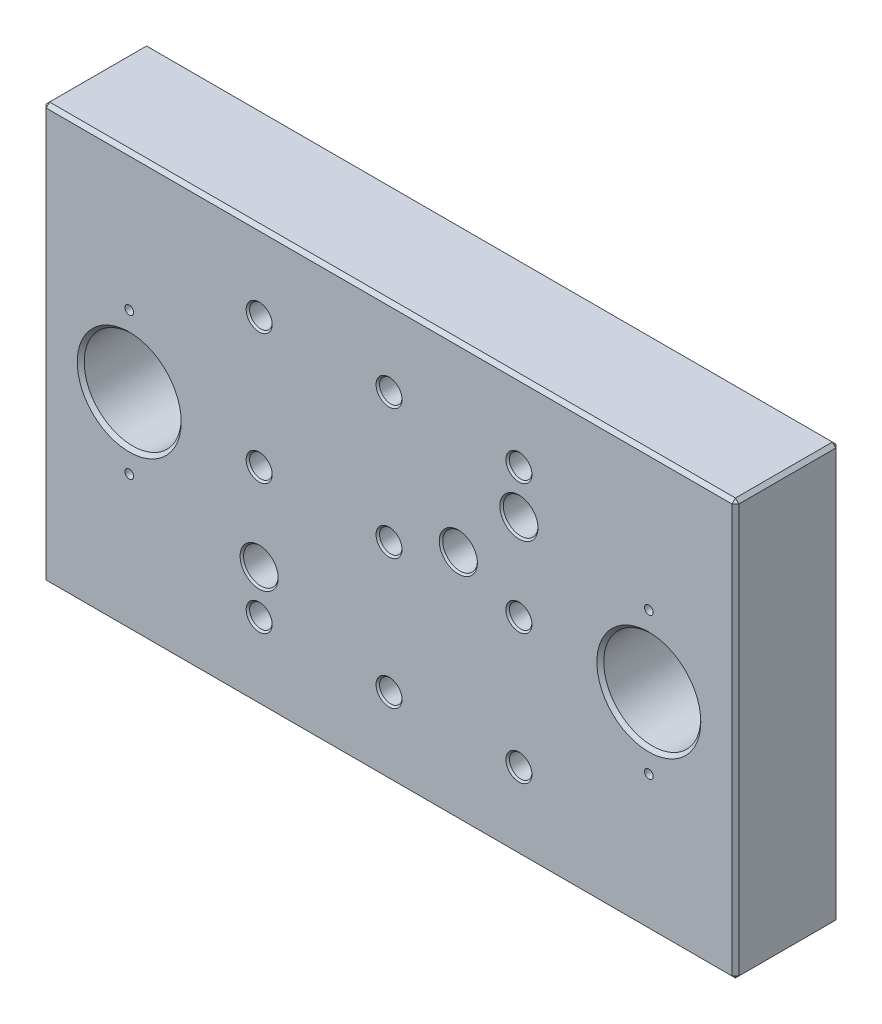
from build123d import *

# Parameters (mm, degrees)
ESQUISSE1_W               = 200
ESQUISSE1_H               = 120
ESQUISSE1_R               = 5
ESQUISSE1_R_2             = 3.25
ESQUISSE1_R_3             = 14
EMBASE_DEPTH              = 30
ESQUISSE2_R               = 5
LAMAGES_VIS_PAUL_ES_DEPTH = 17.5
ESQUISSE4_R               = 6
LAMAGES_VIS_DEPTH         = 20
CHANF_1_SIZE              = 1
CHANF_0_5_SIZE            = 0.5
FIXATION_COLONNE_D        = 2.5
FIXATION_COLONNE_DEPTH    = 12.5
FIXATION_COLONNE_TIP      = 0.751075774


with BuildPart() as part:
    # Esquisse1 → Embase (new body)
    with BuildSketch(Plane.XY):
        Rectangle(ESQUISSE1_W, ESQUISSE1_H)
        with Locations((37.5, 25)):
            Circle(ESQUISSE1_R, mode=Mode.SUBTRACT)
        with Locations((0, 37.5)):
            Circle(ESQUISSE1_R_2, mode=Mode.SUBTRACT)
        with Locations((-37.5, 37.5)):
            Circle(ESQUISSE1_R_2, mode=Mode.SUBTRACT)
        with Locations((37.5, 37.5)):
            Circle(ESQUISSE1_R_2, mode=Mode.SUBTRACT)
        with Locations((37.5, 0)):
            Circle(ESQUISSE1_R_2, mode=Mode.SUBTRACT)
        with Locations((37.5, -37.5)):
            Circle(ESQUISSE1_R_2, mode=Mode.SUBTRACT)
        with Locations((0, -37.5)):
            Circle(ESQUISSE1_R_2, mode=Mode.SUBTRACT)
        with Locations((-37.5, -37.5)):
            Circle(ESQUISSE1_R_2, mode=Mode.SUBTRACT)
        with Locations((-37.5, -25)):
            Circle(ESQUISSE1_R, mode=Mode.SUBTRACT)
        with Locations((-37.5, 0)):
            Circle(ESQUISSE1_R_2, mode=Mode.SUBTRACT)
        with Locations((-75, 0)):
            Circle(ESQUISSE1_R_3, mode=Mode.SUBTRACT)
        with Locations(Location((75, 0, 0), (0, 0, 180))):
            Circle(ESQUISSE1_R_3, mode=Mode.SUBTRACT)
        Circle(ESQUISSE1_R_2, mode=Mode.SUBTRACT)
        with Locations((20, 7.5)):
            Circle(ESQUISSE1_R, mode=Mode.SUBTRACT)
    extrude(amount=-EMBASE_DEPTH)

    # Esquisse2 → Lamages vis _paul_es (cut)
    with BuildSketch(Plane(origin=(0, 0, -30), x_dir=(-1, 0, 0), z_dir=(0, 0, -1))):
        with Locations((37.5, 37.5)):
            Circle(ESQUISSE2_R)
        with Locations(Location((37.5, -37.5, 0), (0, 0, 180))):
            Circle(ESQUISSE2_R)
        with Locations((-37.5, -37.5)):
            Circle(ESQUISSE2_R)
        with Locations(Location((-37.5, 37.5, 0), (0, 0, 180))):
            Circle(ESQUISSE2_R)
    extrude(amount=-LAMAGES_VIS_PAUL_ES_DEPTH, mode=Mode.SUBTRACT)

    # Esquisse4 → Lamages vis (cut)
    with BuildSketch(Plane(origin=(0, 0, -30), x_dir=(-1, 0, 0), z_dir=(0, 0, -1))):
        with Locations((0, 37.5)):
            Circle(ESQUISSE4_R)
        with Locations((37.5, 0)):
            Circle(ESQUISSE4_R)
        with Locations((0, -37.5)):
            Circle(ESQUISSE4_R)
        Circle(ESQUISSE4_R)
        with Locations((-37.5, 0)):
            Circle(ESQUISSE4_R)
    extrude(amount=-LAMAGES_VIS_DEPTH, mode=Mode.SUBTRACT)

    # Chanf 1
    chanf_1_edges = [part.edges().sort_by_distance(p)[0] for p in [
        (100, 0, -30),
        (0, 60, -30),
        (-100, 0, -30),
        (0, 60, 0),
        (100, 0, 0),
        (-89, 0, -30),
        (-89, 0, 0),
        (0, -60, 0),
        (89, 0, -30),
        (89, 0, 0),
        (-100, 0, 0),
        (0, -60, -30),
        (-100, 60, -15),
        (100, 60, -15),
        (100, -60, -15),
        (-100, -60, -15),
    ]]
    chamfer(chanf_1_edges, length=CHANF_1_SIZE)

    # Chanf 0.5
    chanf_0_5_edges = [part.edges().sort_by_distance(p)[0] for p in [
        (-31.5, 0, -30),
        (6, -37.5, -30),
        (6, 0, -30),
        (43.5, 0, -30),
        (32.5, 25, -30),
        (32.5, 25, 0),
        (-3.25, 37.5, 0),
        (-40.75, 37.5, 0),
        (34.25, 37.5, 0),
        (34.25, 0, 0),
        (34.25, -37.5, 0),
        (-3.25, -37.5, 0),
        (-40.75, -37.5, 0),
        (-42.5, -25, -30),
        (-42.5, -25, 0),
        (-40.75, 0, 0),
        (-3.25, 0, 0),
        (15, 7.5, -30),
        (15, 7.5, 0),
        (-32.5, 37.5, -30),
        (-42.5, -37.5, -30),
        (42.5, -37.5, -30),
        (32.5, 37.5, -30),
        (6, 37.5, -30),
    ]]
    chamfer(chanf_0_5_edges, length=CHANF_0_5_SIZE)

    # Fixation colonne
    with Locations(Plane.XY):
        with Locations((-75, 20.5), (-75, -20.5), (75, -20.5), (75, 20.5)):
            Hole(FIXATION_COLONNE_D / 2, depth=FIXATION_COLONNE_DEPTH)
            with Locations((0, 0, -(FIXATION_COLONNE_DEPTH + FIXATION_COLONNE_TIP / 2))):  # 118° drill point
                Cone(0, FIXATION_COLONNE_D / 2, FIXATION_COLONNE_TIP, mode=Mode.SUBTRACT)


solid = part.part
